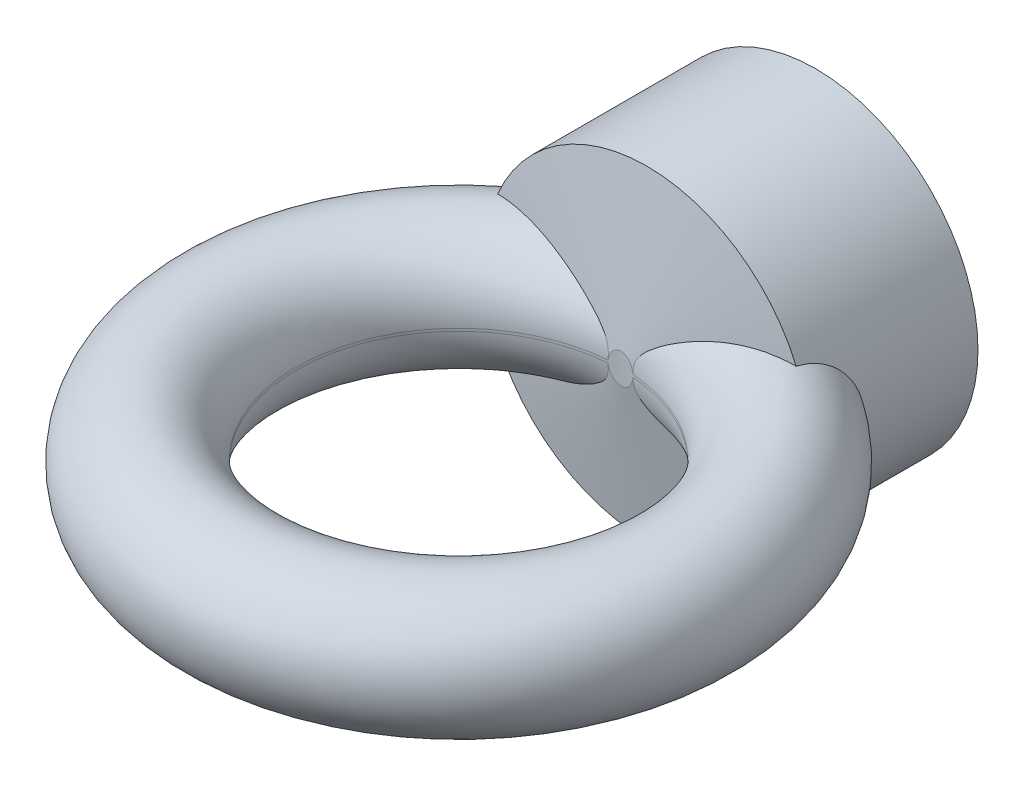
ISO-10303-21;
HEADER;
FILE_DESCRIPTION(('STEP AP214'),'2;1');
FILE_NAME('part.step','',(''),(''),'','','');
FILE_SCHEMA(('AUTOMOTIVE_DESIGN { 1 0 10303 214 1 1 1 1 }'));
ENDSEC;
DATA;
#1=APPLICATION_CONTEXT('core data for automotive mechanical design processes');
#2=APPLICATION_PROTOCOL_DEFINITION('international standard','automotive_design',2000,#1);
#3=PRODUCT_CONTEXT('',#1,'mechanical');
#4=PRODUCT('Part','Part','',(#3));
#5=PRODUCT_RELATED_PRODUCT_CATEGORY('part','',(#4));
#6=PRODUCT_DEFINITION_FORMATION('','',#4);
#7=PRODUCT_DEFINITION_CONTEXT('part definition',#1,'design');
#8=PRODUCT_DEFINITION('design','',#6,#7);
#9=PRODUCT_DEFINITION_SHAPE('','',#8);
#10=(LENGTH_UNIT() NAMED_UNIT(*) SI_UNIT(.MILLI.,.METRE.));
#11=(NAMED_UNIT(*) PLANE_ANGLE_UNIT() SI_UNIT($,.RADIAN.));
#12=(NAMED_UNIT(*) SI_UNIT($,.STERADIAN.) SOLID_ANGLE_UNIT());
#13=UNCERTAINTY_MEASURE_WITH_UNIT(LENGTH_MEASURE(1.E-05),#10,'distance_accuracy_value','');
#14=(GEOMETRIC_REPRESENTATION_CONTEXT(3) GLOBAL_UNCERTAINTY_ASSIGNED_CONTEXT((#13)) GLOBAL_UNIT_ASSIGNED_CONTEXT((#10,
#11,#12)) REPRESENTATION_CONTEXT('',''));
#15=CARTESIAN_POINT('',(0.,0.,0.));
#16=DIRECTION('',(0.,0.,1.));
#17=DIRECTION('',(1.,0.,0.));
#18=AXIS2_PLACEMENT_3D('',#15,#16,#17);
#19=CARTESIAN_POINT('',(398.,-2.07299455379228E-13,78.8999999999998));
#20=DIRECTION('',(0.,0.,-1.));
#21=DIRECTION('',(-1.,0.,0.));
#22=AXIS2_PLACEMENT_3D('',#19,#20,#21);
#23=PLANE('',#22);
#24=CARTESIAN_POINT('',(398.,-2.07299455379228E-13,78.8999999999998));
#25=DIRECTION('',(0.,0.,1.));
#26=DIRECTION('',(1.,0.,0.));
#27=AXIS2_PLACEMENT_3D('',#24,#25,#26);
#28=CIRCLE('',#27,12.5);
#29=CARTESIAN_POINT('',(410.5,-2.07993344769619E-13,78.8999999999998));
#30=VERTEX_POINT('',#29);
#31=EDGE_CURVE('E123',#30,#30,#28,.T.);
#32=ORIENTED_EDGE('',*,*,#31,.F.);
#33=EDGE_LOOP('',(#32));
#34=FACE_BOUND('',#33,.T.);
#35=ADVANCED_FACE('F16',(#34),#23,.T.);
#36=CARTESIAN_POINT('',(398.,0.,106.4));
#37=DIRECTION('',(0.,-1.,0.));
#38=DIRECTION('',(0.,0.,-1.));
#39=AXIS2_PLACEMENT_3D('',#36,#37,#38);
#40=CYLINDRICAL_SURFACE('',#39,12.501);
#41=CARTESIAN_POINT('',(397.048005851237,0.0999962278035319,93.9353015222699));
#42=CARTESIAN_POINT('',(397.053521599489,0.175523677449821,93.9349001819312));
#43=CARTESIAN_POINT('',(397.065339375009,0.250662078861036,93.9339819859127));
#44=CARTESIAN_POINT('',(397.101593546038,0.398461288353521,93.9313058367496));
#45=CARTESIAN_POINT('',(397.126133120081,0.471096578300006,93.9295410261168));
#46=CARTESIAN_POINT('',(397.187341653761,0.609940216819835,93.9254066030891));
#47=CARTESIAN_POINT('',(397.223845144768,0.676221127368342,93.923045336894));
#48=CARTESIAN_POINT('',(397.308750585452,0.800452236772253,93.9180538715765));
#49=CARTESIAN_POINT('',(397.357104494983,0.858434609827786,93.9154247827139));
#50=CARTESIAN_POINT('',(397.448082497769,0.946257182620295,93.9111348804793));
#51=CARTESIAN_POINT('',(397.487714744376,0.97920926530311,93.9094298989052));
#52=CARTESIAN_POINT('',(397.571858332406,1.0382425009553,93.9062630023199));
#53=CARTESIAN_POINT('',(397.616367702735,1.06432641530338,93.9048009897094));
#54=CARTESIAN_POINT('',(397.709775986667,1.10827636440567,93.9022815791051));
#55=CARTESIAN_POINT('',(397.758707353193,1.12607455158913,93.9012275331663));
#56=CARTESIAN_POINT('',(397.859117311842,1.15173584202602,93.8996935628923));
#57=CARTESIAN_POINT('',(397.910593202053,1.15960925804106,93.8992130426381));
#58=CARTESIAN_POINT('',(398.007103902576,1.16439621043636,93.8989215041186));
#59=CARTESIAN_POINT('',(398.052076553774,1.16263815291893,93.8990293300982));
#60=CARTESIAN_POINT('',(398.141013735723,1.15130609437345,93.8997162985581));
#61=CARTESIAN_POINT('',(398.184978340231,1.14173266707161,93.9002954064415));
#62=CARTESIAN_POINT('',(398.269182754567,1.11585894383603,93.9018298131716));
#63=CARTESIAN_POINT('',(398.309498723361,1.09980193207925,93.9027714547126));
#64=CARTESIAN_POINT('',(398.387246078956,1.06182974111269,93.9049387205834));
#65=CARTESIAN_POINT('',(398.424676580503,1.0399127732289,93.9061644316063));
#66=CARTESIAN_POINT('',(398.500189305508,0.988348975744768,93.9089472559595));
#67=CARTESIAN_POINT('',(398.537862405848,0.958106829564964,93.9105261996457));
#68=CARTESIAN_POINT('',(398.608577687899,0.892652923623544,93.9137720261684));
#69=CARTESIAN_POINT('',(398.641618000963,0.857439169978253,93.9154389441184));
#70=CARTESIAN_POINT('',(398.708562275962,0.776136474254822,93.9190438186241));
#71=CARTESIAN_POINT('',(398.741488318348,0.729242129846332,93.9209746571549));
#72=CARTESIAN_POINT('',(398.800426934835,0.631239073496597,93.9246168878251));
#73=CARTESIAN_POINT('',(398.826429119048,0.580124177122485,93.9263279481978));
#74=CARTESIAN_POINT('',(398.877857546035,0.45973753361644,93.9298257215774));
#75=CARTESIAN_POINT('',(398.900971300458,0.389468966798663,93.9314928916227));
#76=CARTESIAN_POINT('',(398.935352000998,0.246242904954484,93.9340345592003));
#77=CARTESIAN_POINT('',(398.946646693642,0.173292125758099,93.9349109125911));
#78=CARTESIAN_POINT('',(398.951994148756,0.0999962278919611,93.9353015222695));
#79=B_SPLINE_CURVE_WITH_KNOTS('',3,(#41,#42,#43,#44,#45,#46,#47,#48,#49,#50,#51,#52,#53,#54,#55,
#56,#57,#58,#59,#60,#61,#62,#63,#64,#65,#66,#67,#68,#69,#70,#71,#72,#73,#74,#75,#76,#77,#78),
.UNSPECIFIED.,.F.,.F.,(4,2,2,2,2,2,2,2,2,2,2,2,2,2,2,2,2,2,4),(0.,0.227052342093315,
0.455975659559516,0.68185775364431,0.906838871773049,1.06096165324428,1.2150223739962,
1.37032334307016,1.5254628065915,1.6597932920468,1.79411391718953,1.92380389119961,
2.05353349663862,2.19800236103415,2.34252933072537,2.51388128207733,2.68548893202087,
2.90640793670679,3.12680713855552),.UNSPECIFIED.);
#80=CARTESIAN_POINT('',(397.048005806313,0.0999956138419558,93.935301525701));
#81=VERTEX_POINT('',#80);
#82=CARTESIAN_POINT('',(398.951994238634,0.099994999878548,93.9353015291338));
#83=VERTEX_POINT('',#82);
#84=EDGE_CURVE('E116',#81,#83,#79,.T.);
#85=ORIENTED_EDGE('',*,*,#84,.F.);
#86=CARTESIAN_POINT('',(398.,0.0999949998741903,106.4));
#87=DIRECTION('',(0.,-1.,0.));
#88=DIRECTION('',(1.,0.,0.));
#89=AXIS2_PLACEMENT_3D('',#86,#87,#88);
#90=CIRCLE('',#89,12.501);
#91=EDGE_CURVE('E115',#83,#81,#90,.T.);
#92=ORIENTED_EDGE('',*,*,#91,.F.);
#93=EDGE_LOOP('',(#85,#92));
#94=FACE_BOUND('',#93,.T.);
#95=CARTESIAN_POINT('',(398.951994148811,-0.0999962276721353,93.9353015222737));
#96=CARTESIAN_POINT('',(398.946478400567,-0.175523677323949,93.9349001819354));
#97=CARTESIAN_POINT('',(398.934660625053,-0.250662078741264,93.9339819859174));
#98=CARTESIAN_POINT('',(398.898406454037,-0.398461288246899,93.931305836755));
#99=CARTESIAN_POINT('',(398.873866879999,-0.47109657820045,93.9295410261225));
#100=CARTESIAN_POINT('',(398.81265834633,-0.60994021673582,93.9254066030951));
#101=CARTESIAN_POINT('',(398.776154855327,-0.676221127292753,93.9230453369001));
#102=CARTESIAN_POINT('',(398.691249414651,-0.800452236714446,93.9180538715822));
#103=CARTESIAN_POINT('',(398.642895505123,-0.858434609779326,93.9154247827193));
#104=CARTESIAN_POINT('',(398.551917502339,-0.946257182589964,93.9111348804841));
#105=CARTESIAN_POINT('',(398.512285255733,-0.979209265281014,93.9094298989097));
#106=CARTESIAN_POINT('',(398.428141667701,-1.03824250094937,93.9062630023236));
#107=CARTESIAN_POINT('',(398.38363229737,-1.06432641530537,93.9048009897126));
#108=CARTESIAN_POINT('',(398.290224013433,-1.10827636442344,93.9022815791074));
#109=CARTESIAN_POINT('',(398.241292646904,-1.12607455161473,93.9012275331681));
#110=CARTESIAN_POINT('',(398.140882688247,-1.15173584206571,93.8996935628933));
#111=CARTESIAN_POINT('',(398.089406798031,-1.15960925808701,93.8992130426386));
#112=CARTESIAN_POINT('',(397.9928960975,-1.16439621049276,93.8989215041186));
#113=CARTESIAN_POINT('',(397.947923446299,-1.16263815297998,93.899029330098));
#114=CARTESIAN_POINT('',(397.858986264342,-1.15130609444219,93.8997162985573));
#115=CARTESIAN_POINT('',(397.81502165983,-1.14173266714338,93.9002954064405));
#116=CARTESIAN_POINT('',(397.730817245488,-1.11585894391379,93.9018298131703));
#117=CARTESIAN_POINT('',(397.690501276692,-1.09980193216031,93.9027714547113));
#118=CARTESIAN_POINT('',(397.612753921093,-1.06182974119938,93.9049387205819));
#119=CARTESIAN_POINT('',(397.575323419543,-1.03991277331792,93.9061644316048));
#120=CARTESIAN_POINT('',(397.499810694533,-0.988348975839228,93.9089472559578));
#121=CARTESIAN_POINT('',(397.462137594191,-0.958106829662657,93.910526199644));
#122=CARTESIAN_POINT('',(397.391422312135,-0.892652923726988,93.9137720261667));
#123=CARTESIAN_POINT('',(397.358381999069,-0.857439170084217,93.9154389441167));
#124=CARTESIAN_POINT('',(397.291437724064,-0.776136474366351,93.9190438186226));
#125=CARTESIAN_POINT('',(397.258511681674,-0.72924212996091,93.9209746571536));
#126=CARTESIAN_POINT('',(397.19957306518,-0.631239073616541,93.9246168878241));
#127=CARTESIAN_POINT('',(397.173570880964,-0.580124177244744,93.926327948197));
#128=CARTESIAN_POINT('',(397.122142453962,-0.459737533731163,93.9298257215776));
#129=CARTESIAN_POINT('',(397.099028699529,-0.389468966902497,93.9314928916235));
#130=CARTESIAN_POINT('',(397.064647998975,-0.246242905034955,93.9340345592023));
#131=CARTESIAN_POINT('',(397.053353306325,-0.173292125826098,93.9349109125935));
#132=CARTESIAN_POINT('',(397.048005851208,-0.099996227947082,93.9353015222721));
#133=B_SPLINE_CURVE_WITH_KNOTS('',3,(#95,#96,#97,#98,#99,#100,#101,#102,#103,#104,#105,#106,
#107,#108,#109,#110,#111,#112,#113,#114,#115,#116,#117,#118,#119,#120,#121,#122,#123,#124,#125,
#126,#127,#128,#129,#130,#131,#132),.UNSPECIFIED.,.F.,.F.,(4,2,2,2,2,2,2,2,2,2,2,2,2,2,2,2,2,2,
4),(0.,0.227052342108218,0.455975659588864,0.68185775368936,0.906838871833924,1.0609616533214,
1.21502237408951,1.37032334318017,1.52546280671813,1.6597932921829,1.7941139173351,
1.92380389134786,2.05353349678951,2.19800236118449,2.3425293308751,2.51388128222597,
2.68548893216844,2.90640793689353,3.1268071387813),.UNSPECIFIED.);
#134=CARTESIAN_POINT('',(398.95199419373,-0.0999956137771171,93.9353015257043));
#135=VERTEX_POINT('',#134);
#136=CARTESIAN_POINT('',(397.048005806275,-0.0999956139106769,93.9353015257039));
#137=VERTEX_POINT('',#136);
#138=EDGE_CURVE('E22',#135,#137,#133,.T.);
#139=ORIENTED_EDGE('',*,*,#138,.F.);
#140=CARTESIAN_POINT('',(398.,-0.0999949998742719,106.4));
#141=DIRECTION('',(0.,-1.,0.));
#142=DIRECTION('',(1.,0.,0.));
#143=AXIS2_PLACEMENT_3D('',#140,#141,#142);
#144=CIRCLE('',#143,12.501);
#145=EDGE_CURVE('E60',#137,#135,#144,.F.);
#146=ORIENTED_EDGE('',*,*,#145,.F.);
#147=EDGE_LOOP('',(#139,#146));
#148=FACE_BOUND('',#147,.T.);
#149=ADVANCED_FACE('F71',(#94,#148),#40,.F.);
#150=CARTESIAN_POINT('',(398.,-1.51788304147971E-13,91.9000000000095));
#151=DIRECTION('',(0.,0.,-1.));
#152=DIRECTION('',(-1.,0.,0.));
#153=AXIS2_PLACEMENT_3D('',#150,#151,#152);
#154=CONICAL_SURFACE('',#153,12.4999999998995,1.39626340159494);
#155=CARTESIAN_POINT('',(398.,-1.51788304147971E-13,91.8999999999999));
#156=DIRECTION('',(0.,0.,1.));
#157=DIRECTION('',(1.,0.,0.));
#158=AXIS2_PLACEMENT_3D('',#155,#156,#157);
#159=CIRCLE('',#158,12.5);
#160=CARTESIAN_POINT('',(409.500623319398,-4.89751603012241,91.8999999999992));
#161=VERTEX_POINT('',#160);
#162=CARTESIAN_POINT('',(386.499376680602,-4.89751603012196,91.8999999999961));
#163=VERTEX_POINT('',#162);
#164=EDGE_CURVE('E70',#161,#163,#159,.F.);
#165=ORIENTED_EDGE('',*,*,#164,.F.);
#166=CARTESIAN_POINT('',(398.95199424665,-0.0999962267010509,93.9353015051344));
#167=CARTESIAN_POINT('',(398.952304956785,-0.142163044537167,93.9344798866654));
#168=CARTESIAN_POINT('',(398.952743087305,-0.184324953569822,93.9331316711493));
#169=CARTESIAN_POINT('',(398.95433561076,-0.268863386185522,93.9294091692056));
#170=CARTESIAN_POINT('',(398.955494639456,-0.311239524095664,93.9270282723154));
#171=CARTESIAN_POINT('',(398.959002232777,-0.395976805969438,93.9212727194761));
#172=CARTESIAN_POINT('',(398.961353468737,-0.438337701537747,93.9178958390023));
#173=CARTESIAN_POINT('',(398.967860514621,-0.522279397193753,93.910268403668));
#174=CARTESIAN_POINT('',(398.971991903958,-0.563863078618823,93.9060300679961));
#175=CARTESIAN_POINT('',(398.982680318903,-0.64654286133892,93.8967524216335));
#176=CARTESIAN_POINT('',(398.989231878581,-0.68763984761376,93.8917149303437));
#177=CARTESIAN_POINT('',(399.005273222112,-0.769120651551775,93.8809568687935));
#178=CARTESIAN_POINT('',(399.014759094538,-0.809505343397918,93.8752372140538));
#179=CARTESIAN_POINT('',(399.035106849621,-0.882712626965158,93.8642411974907));
#180=CARTESIAN_POINT('',(399.045483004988,-0.915682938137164,93.8590475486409));
#181=CARTESIAN_POINT('',(399.068481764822,-0.980818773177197,93.8483594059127));
#182=CARTESIAN_POINT('',(399.081106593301,-1.01298346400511,93.842864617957));
#183=CARTESIAN_POINT('',(399.108476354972,-1.07635817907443,93.8316586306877));
#184=CARTESIAN_POINT('',(399.123221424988,-1.10756814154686,93.8259474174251));
#185=CARTESIAN_POINT('',(399.154610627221,-1.16893545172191,93.8143833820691));
#186=CARTESIAN_POINT('',(399.1712523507,-1.19909407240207,93.8085307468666));
#187=CARTESIAN_POINT('',(399.206214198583,-1.25839312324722,93.7967294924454));
#188=CARTESIAN_POINT('',(399.224534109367,-1.28753368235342,93.7907808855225));
#189=CARTESIAN_POINT('',(399.262622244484,-1.34483479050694,93.7788242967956));
#190=CARTESIAN_POINT('',(399.282390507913,-1.37299531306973,93.7728163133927));
#191=CARTESIAN_POINT('',(399.348948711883,-1.46344849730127,93.7531453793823));
#192=CARTESIAN_POINT('',(399.39828777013,-1.52385573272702,93.7394129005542));
#193=CARTESIAN_POINT('',(399.501388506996,-1.64085074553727,93.7119204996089));
#194=CARTESIAN_POINT('',(399.555157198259,-1.69743219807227,93.6981605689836));
#195=CARTESIAN_POINT('',(399.665858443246,-1.80749526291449,93.6706631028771));
#196=CARTESIAN_POINT('',(399.722793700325,-1.86097414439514,93.6569255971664));
#197=CARTESIAN_POINT('',(399.839708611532,-1.96601478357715,93.6293223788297));
#198=CARTESIAN_POINT('',(399.899717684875,-2.01754369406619,93.6154572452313));
#199=CARTESIAN_POINT('',(400.021487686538,-2.11834535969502,93.5877860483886));
#200=CARTESIAN_POINT('',(400.083246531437,-2.16762062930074,93.5739799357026));
#201=CARTESIAN_POINT('',(400.208200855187,-2.26428271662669,93.5464087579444));
#202=CARTESIAN_POINT('',(400.271395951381,-2.31167002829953,93.5326436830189));
#203=CARTESIAN_POINT('',(400.441728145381,-2.43601625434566,93.4959310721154));
#204=CARTESIAN_POINT('',(400.549937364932,-2.51151536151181,93.4730105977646));
#205=CARTESIAN_POINT('',(400.768946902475,-2.65869355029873,93.4272313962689));
#206=CARTESIAN_POINT('',(400.879747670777,-2.73037196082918,93.4043726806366));
#207=CARTESIAN_POINT('',(401.103646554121,-2.87042424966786,93.3586742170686));
#208=CARTESIAN_POINT('',(401.216747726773,-2.93879325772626,93.3358345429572));
#209=CARTESIAN_POINT('',(401.444813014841,-3.07237090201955,93.290199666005));
#210=CARTESIAN_POINT('',(401.559777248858,-3.13757933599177,93.2674044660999));
#211=CARTESIAN_POINT('',(401.907327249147,-3.3287794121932,93.1990498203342));
#212=CARTESIAN_POINT('',(402.142425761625,-3.45025621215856,93.1535507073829));
#213=CARTESIAN_POINT('',(402.617229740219,-3.68089939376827,93.0629487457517));
#214=CARTESIAN_POINT('',(402.856908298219,-3.79012105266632,93.0178450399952));
#215=CARTESIAN_POINT('',(403.341198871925,-3.99642157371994,92.9278980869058));
#216=CARTESIAN_POINT('',(403.58580558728,-4.09351274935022,92.8830546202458));
#217=CARTESIAN_POINT('',(404.079663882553,-4.27488036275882,92.7936564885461));
#218=CARTESIAN_POINT('',(404.328913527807,-4.35916200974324,92.7491017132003));
#219=CARTESIAN_POINT('',(404.881888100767,-4.52936710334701,92.6514788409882));
#220=CARTESIAN_POINT('',(405.18656664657,-4.61226792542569,92.5984843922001));
#221=CARTESIAN_POINT('',(405.801342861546,-4.75607371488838,92.4931225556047));
#222=CARTESIAN_POINT('',(406.111442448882,-4.81697072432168,92.440755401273));
#223=CARTESIAN_POINT('',(406.734549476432,-4.91399637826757,92.3370586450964));
#224=CARTESIAN_POINT('',(407.047542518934,-4.95021297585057,92.2857259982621));
#225=CARTESIAN_POINT('',(407.675540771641,-4.99535251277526,92.18419958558));
#226=CARTESIAN_POINT('',(407.990544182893,-5.0042971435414,92.1340049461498));
#227=CARTESIAN_POINT('',(408.505140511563,-4.99411607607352,92.0531464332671));
#228=CARTESIAN_POINT('',(408.704860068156,-4.98405038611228,92.0220457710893));
#229=CARTESIAN_POINT('',(409.103564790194,-4.95083066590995,91.9604966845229));
#230=CARTESIAN_POINT('',(409.302548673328,-4.92765974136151,91.9300491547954));
#231=CARTESIAN_POINT('',(409.500623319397,-4.89751603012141,91.8999999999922));
#232=B_SPLINE_CURVE_WITH_KNOTS('',3,(#166,#167,#168,#169,#170,#171,#172,#173,#174,#175,#176,
#177,#178,#179,#180,#181,#182,#183,#184,#185,#186,#187,#188,#189,#190,#191,#192,#193,#194,#195,
#196,#197,#198,#199,#200,#201,#202,#203,#204,#205,#206,#207,#208,#209,#210,#211,#212,#213,#214,
#215,#216,#217,#218,#219,#220,#221,#222,#223,#224,#225,#226,#227,#228,#229,#230,#231),
.UNSPECIFIED.,.F.,.F.,(4,2,2,2,2,2,2,2,2,2,2,2,2,2,2,2,2,2,2,2,2,2,2,2,2,2,2,2,2,2,2,2,4),(0.,
0.126534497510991,0.253891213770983,0.381534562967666,0.507479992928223,0.633142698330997,
0.758638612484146,0.863415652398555,0.968296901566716,1.0731849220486,1.17794118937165,
1.28268414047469,1.38742991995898,1.62467744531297,1.86230805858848,2.10014475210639,
2.34099282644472,2.58156527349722,2.82207435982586,3.22372890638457,3.62545377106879,
4.02775289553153,4.43007773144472,5.23524456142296,6.03661977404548,6.8371747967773,
7.63740338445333,8.59717078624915,9.55728495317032,10.5139594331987,11.4698728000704,
12.0766120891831,12.6841353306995),.UNSPECIFIED.);
#233=EDGE_CURVE('E68',#135,#161,#232,.T.);
#234=ORIENTED_EDGE('',*,*,#233,.F.);
#235=ORIENTED_EDGE('',*,*,#138,.T.);
#236=CARTESIAN_POINT('',(386.499376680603,-4.89751603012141,91.8999999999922));
#237=CARTESIAN_POINT('',(386.683740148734,-4.92557666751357,91.9279690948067));
#238=CARTESIAN_POINT('',(386.868918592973,-4.94759451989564,91.956287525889));
#239=CARTESIAN_POINT('',(387.239848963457,-4.98019717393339,92.0134796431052));
#240=CARTESIAN_POINT('',(387.425599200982,-4.99080299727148,92.0423522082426));
#241=CARTESIAN_POINT('',(387.797209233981,-5.00132996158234,92.1005984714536));
#242=CARTESIAN_POINT('',(387.983068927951,-5.00125645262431,92.129971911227));
#243=CARTESIAN_POINT('',(388.353902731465,-4.99110588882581,92.1890753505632));
#244=CARTESIAN_POINT('',(388.538877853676,-4.98105743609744,92.2188040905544));
#245=CARTESIAN_POINT('',(388.908099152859,-4.95161255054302,92.2786505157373));
#246=CARTESIAN_POINT('',(389.092344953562,-4.93221180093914,92.3087683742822));
#247=CARTESIAN_POINT('',(389.459675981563,-4.88464340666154,92.3693302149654));
#248=CARTESIAN_POINT('',(389.642760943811,-4.85647382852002,92.3997742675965));
#249=CARTESIAN_POINT('',(390.091858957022,-4.77697306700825,92.4750974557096));
#250=CARTESIAN_POINT('',(390.357023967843,-4.72095660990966,92.520134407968));
#251=CARTESIAN_POINT('',(390.88340824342,-4.5929031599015,92.6106779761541));
#252=CARTESIAN_POINT('',(391.144626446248,-4.52086193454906,92.6561847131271));
#253=CARTESIAN_POINT('',(391.662582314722,-4.36210294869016,92.7475769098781));
#254=CARTESIAN_POINT('',(391.919318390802,-4.27538009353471,92.7934624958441));
#255=CARTESIAN_POINT('',(392.427689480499,-4.08842757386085,92.8855075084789));
#256=CARTESIAN_POINT('',(392.679325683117,-3.98820110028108,92.9316668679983));
#257=CARTESIAN_POINT('',(393.177019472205,-3.77508489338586,93.0241946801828));
#258=CARTESIAN_POINT('',(393.423078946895,-3.6621995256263,93.0705630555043));
#259=CARTESIAN_POINT('',(393.909032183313,-3.42419054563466,93.1634639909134));
#260=CARTESIAN_POINT('',(394.148929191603,-3.29907355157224,93.2099964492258));
#261=CARTESIAN_POINT('',(394.490747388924,-3.10896785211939,93.2774185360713));
#262=CARTESIAN_POINT('',(394.595519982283,-3.04904328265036,93.2982410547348));
#263=CARTESIAN_POINT('',(394.803495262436,-2.92654016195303,93.3399241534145));
#264=CARTESIAN_POINT('',(394.906698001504,-2.86396169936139,93.3607847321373));
#265=CARTESIAN_POINT('',(395.111619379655,-2.73576380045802,93.4026115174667));
#266=CARTESIAN_POINT('',(395.213332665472,-2.67013583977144,93.423577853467));
#267=CARTESIAN_POINT('',(395.414606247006,-2.53570075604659,93.4655603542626));
#268=CARTESIAN_POINT('',(395.514166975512,-2.46689428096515,93.4865765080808));
#269=CARTESIAN_POINT('',(395.678424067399,-2.34871971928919,93.5217803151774));
#270=CARTESIAN_POINT('',(395.743856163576,-2.30036872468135,93.5359493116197));
#271=CARTESIAN_POINT('',(395.873270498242,-2.20173436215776,93.5643288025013));
#272=CARTESIAN_POINT('',(395.93725237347,-2.15145051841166,93.5785393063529));
#273=CARTESIAN_POINT('',(396.063460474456,-2.04857617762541,93.6070219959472));
#274=CARTESIAN_POINT('',(396.125684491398,-1.99598297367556,93.6212942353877));
#275=CARTESIAN_POINT('',(396.247487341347,-1.8883201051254,93.6498273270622));
#276=CARTESIAN_POINT('',(396.307076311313,-1.83326194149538,93.6640879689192));
#277=CARTESIAN_POINT('',(396.422988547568,-1.71990180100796,93.692636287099));
#278=CARTESIAN_POINT('',(396.479314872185,-1.66160296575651,93.7069239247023));
#279=CARTESIAN_POINT('',(396.587357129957,-1.54097813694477,93.7354769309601));
#280=CARTESIAN_POINT('',(396.639080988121,-1.47865939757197,93.7497422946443));
#281=CARTESIAN_POINT('',(396.716423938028,-1.37508102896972,93.7724053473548));
#282=CARTESIAN_POINT('',(396.744176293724,-1.33543047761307,93.7808557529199));
#283=CARTESIAN_POINT('',(396.796708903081,-1.25416329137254,93.7976254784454));
#284=CARTESIAN_POINT('',(396.82148928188,-1.21254673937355,93.8059448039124));
#285=CARTESIAN_POINT('',(396.867271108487,-1.12756791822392,93.8222783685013));
#286=CARTESIAN_POINT('',(396.888295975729,-1.08421869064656,93.8302942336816));
#287=CARTESIAN_POINT('',(396.926185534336,-0.995668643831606,93.8458978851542));
#288=CARTESIAN_POINT('',(396.943051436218,-0.950468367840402,93.8534857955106));
#289=CARTESIAN_POINT('',(396.972382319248,-0.858525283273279,93.8680174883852));
#290=CARTESIAN_POINT('',(396.984843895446,-0.811781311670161,93.8749607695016));
#291=CARTESIAN_POINT('',(397.005607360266,-0.717259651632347,93.887966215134));
#292=CARTESIAN_POINT('',(397.0139078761,-0.669481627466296,93.8940280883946));
#293=CARTESIAN_POINT('',(397.027144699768,-0.573032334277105,93.9051090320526));
#294=CARTESIAN_POINT('',(397.032057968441,-0.524357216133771,93.9101208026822));
#295=CARTESIAN_POINT('',(397.03945809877,-0.426728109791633,93.9189050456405));
#296=CARTESIAN_POINT('',(397.041944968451,-0.377774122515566,93.9226775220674));
#297=CARTESIAN_POINT('',(397.045088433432,-0.290541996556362,93.9282016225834));
#298=CARTESIAN_POINT('',(397.04602760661,-0.252288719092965,93.9302153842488));
#299=CARTESIAN_POINT('',(397.047348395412,-0.176024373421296,93.9333913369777));
#300=CARTESIAN_POINT('',(397.047734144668,-0.138013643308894,93.9345598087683));
#301=CARTESIAN_POINT('',(397.048005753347,-0.0999962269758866,93.9353015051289));
#302=B_SPLINE_CURVE_WITH_KNOTS('',3,(#236,#237,#238,#239,#240,#241,#242,#243,#244,#245,#246,
#247,#248,#249,#250,#251,#252,#253,#254,#255,#256,#257,#258,#259,#260,#261,#262,#263,#264,#265,
#266,#267,#268,#269,#270,#271,#272,#273,#274,#275,#276,#277,#278,#279,#280,#281,#282,#283,#284,
#285,#286,#287,#288,#289,#290,#291,#292,#293,#294,#295,#296,#297,#298,#299,#300,#301),
.UNSPECIFIED.,.F.,.F.,(4,2,2,2,2,2,2,2,2,2,2,2,2,2,2,2,2,2,2,2,2,2,2,2,2,2,2,2,2,2,2,2,4),(0.,
0.565544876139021,1.13004618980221,1.69426470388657,2.25687003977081,2.81973530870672,
3.38272477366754,4.20635238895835,5.03019779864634,5.85432967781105,6.67826715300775,
7.50192135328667,8.32513233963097,8.69254883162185,9.05995306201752,9.42845463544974,
9.79688141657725,10.0446018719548,10.2923837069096,10.5404641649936,10.7874880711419,
11.0342765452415,11.2806314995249,11.4279188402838,11.5751999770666,11.7215279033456,
11.86781318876,12.0142113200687,12.1606577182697,12.3080906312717,12.4555230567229,
12.5704637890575,12.6845414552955),.UNSPECIFIED.);
#303=EDGE_CURVE('E67',#163,#137,#302,.T.);
#304=ORIENTED_EDGE('',*,*,#303,.F.);
#305=EDGE_LOOP('',(#165,#234,#235,#304));
#306=FACE_BOUND('',#305,.T.);
#307=ADVANCED_FACE('F66',(#306),#154,.T.);
#308=CARTESIAN_POINT('',(398.,0.,85.3999999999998));
#309=DIRECTION('',(0.,0.,1.));
#310=DIRECTION('',(1.,0.,0.));
#311=AXIS2_PLACEMENT_3D('',#308,#309,#310);
#312=CYLINDRICAL_SURFACE('',#311,12.5);
#313=ORIENTED_EDGE('',*,*,#31,.T.);
#314=EDGE_LOOP('',(#313));
#315=FACE_BOUND('',#314,.T.);
#316=CARTESIAN_POINT('',(398.,-1.24032728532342E-13,91.8999999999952));
#317=DIRECTION('',(0.,0.,-1.));
#318=DIRECTION('',(1.,0.,0.));
#319=AXIS2_PLACEMENT_3D('',#316,#317,#318);
#320=CIRCLE('',#319,12.5000000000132);
#321=CARTESIAN_POINT('',(409.500623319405,4.89751603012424,91.8999999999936));
#322=VERTEX_POINT('',#321);
#323=CARTESIAN_POINT('',(386.499376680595,4.89751603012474,91.8999999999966));
#324=VERTEX_POINT('',#323);
#325=EDGE_CURVE('E113',#322,#324,#320,.F.);
#326=ORIENTED_EDGE('',*,*,#325,.F.);
#327=CARTESIAN_POINT('',(409.500623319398,-4.89751603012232,91.8999999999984));
#328=CARTESIAN_POINT('',(409.507610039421,-4.88110031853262,91.8036380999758));
#329=CARTESIAN_POINT('',(409.5154718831,-4.86254981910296,91.7076908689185));
#330=CARTESIAN_POINT('',(409.532938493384,-4.82098151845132,91.5168319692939));
#331=CARTESIAN_POINT('',(409.542544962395,-4.79795935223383,91.4219214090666));
#332=CARTESIAN_POINT('',(409.563482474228,-4.74727485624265,91.2335076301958));
#333=CARTESIAN_POINT('',(409.574813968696,-4.71961131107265,91.1400047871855));
#334=CARTESIAN_POINT('',(409.599170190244,-4.65943225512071,90.9545271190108));
#335=CARTESIAN_POINT('',(409.612199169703,-4.62690452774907,90.8625568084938));
#336=CARTESIAN_POINT('',(409.639827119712,-4.55695486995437,90.6807627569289));
#337=CARTESIAN_POINT('',(409.6544256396,-4.51953434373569,90.590938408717));
#338=CARTESIAN_POINT('',(409.68505458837,-4.43974367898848,90.4137822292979));
#339=CARTESIAN_POINT('',(409.701084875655,-4.39737402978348,90.3264501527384));
#340=CARTESIAN_POINT('',(409.742879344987,-4.28485710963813,90.1109366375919));
#341=CARTESIAN_POINT('',(409.769450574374,-4.21153505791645,89.9845477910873));
#342=CARTESIAN_POINT('',(409.82471987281,-4.05376111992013,89.7393995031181));
#343=CARTESIAN_POINT('',(409.853418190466,-3.9693079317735,89.6206409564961));
#344=CARTESIAN_POINT('',(409.911991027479,-3.78990109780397,89.3920663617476));
#345=CARTESIAN_POINT('',(409.941862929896,-3.69497004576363,89.282231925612));
#346=CARTESIAN_POINT('',(410.001874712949,-3.49512228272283,89.0721534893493));
#347=CARTESIAN_POINT('',(410.032014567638,-3.39020652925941,88.9719085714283));
#348=CARTESIAN_POINT('',(410.088993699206,-3.18071859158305,88.7900013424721));
#349=CARTESIAN_POINT('',(410.115892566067,-3.07690537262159,88.7074814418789));
#350=CARTESIAN_POINT('',(410.168372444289,-2.86232630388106,88.5514826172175));
#351=CARTESIAN_POINT('',(410.193953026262,-2.75155821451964,88.4780066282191));
#352=CARTESIAN_POINT('',(410.243126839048,-2.52377378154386,88.3404134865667));
#353=CARTESIAN_POINT('',(410.266717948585,-2.40675098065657,88.2763062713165));
#354=CARTESIAN_POINT('',(410.311262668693,-2.16740126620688,88.1578132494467));
#355=CARTESIAN_POINT('',(410.332216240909,-2.04507427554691,88.1034275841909));
#356=CARTESIAN_POINT('',(410.370941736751,-1.79601748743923,88.0045926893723));
#357=CARTESIAN_POINT('',(410.388714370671,-1.66928868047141,87.960141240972));
#358=CARTESIAN_POINT('',(410.420630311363,-1.41233693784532,87.8813198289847));
#359=CARTESIAN_POINT('',(410.434774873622,-1.28211522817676,87.846946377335));
#360=CARTESIAN_POINT('',(410.459067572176,-1.01932092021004,87.7884242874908));
#361=CARTESIAN_POINT('',(410.469223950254,-0.886753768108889,87.7642545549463));
#362=CARTESIAN_POINT('',(410.485330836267,-0.619963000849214,87.7261126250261));
#363=CARTESIAN_POINT('',(410.491283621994,-0.485740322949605,87.7121349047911));
#364=CARTESIAN_POINT('',(410.496708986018,-0.292726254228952,87.6994149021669));
#365=CARTESIAN_POINT('',(410.497942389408,-0.234228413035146,87.6965271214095));
#366=CARTESIAN_POINT('',(410.499588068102,-0.117156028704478,87.6926760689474));
#367=CARTESIAN_POINT('',(410.500000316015,-0.0585814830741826,87.6917128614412));
#368=CARTESIAN_POINT('',(410.499999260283,0.13712564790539,87.6917135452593));
#369=CARTESIAN_POINT('',(410.497738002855,0.274289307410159,87.6969927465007));
#370=CARTESIAN_POINT('',(410.4887446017,0.547712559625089,87.7181027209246));
#371=CARTESIAN_POINT('',(410.48200993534,0.683971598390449,87.7339394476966));
#372=CARTESIAN_POINT('',(410.464218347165,0.954837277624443,87.7761679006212));
#373=CARTESIAN_POINT('',(410.453153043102,1.08944018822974,87.8025800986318));
#374=CARTESIAN_POINT('',(410.426974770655,1.35580826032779,87.865895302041));
#375=CARTESIAN_POINT('',(410.411860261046,1.48757232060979,87.9028023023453));
#376=CARTESIAN_POINT('',(410.377986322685,1.74716203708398,87.9869541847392));
#377=CARTESIAN_POINT('',(410.359229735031,1.8749906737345,88.0341910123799));
#378=CARTESIAN_POINT('',(410.318544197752,2.12594343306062,88.1388782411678));
#379=CARTESIAN_POINT('',(410.296613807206,2.2490653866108,88.1963332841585));
#380=CARTESIAN_POINT('',(410.250186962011,2.48956015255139,88.3211754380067));
#381=CARTESIAN_POINT('',(410.22569214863,2.60693657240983,88.3885562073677));
#382=CARTESIAN_POINT('',(410.174804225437,2.83510134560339,88.5329385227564));
#383=CARTESIAN_POINT('',(410.14841203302,2.94589283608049,88.6099354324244));
#384=CARTESIAN_POINT('',(410.094734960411,3.15900889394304,88.7723191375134));
#385=CARTESIAN_POINT('',(410.067462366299,3.26141016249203,88.8576093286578));
#386=CARTESIAN_POINT('',(410.01252654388,3.45827242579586,89.03671830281));
#387=CARTESIAN_POINT('',(409.984863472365,3.55273650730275,89.1305337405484));
#388=CARTESIAN_POINT('',(409.929897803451,3.73315349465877,89.3261146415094));
#389=CARTESIAN_POINT('',(409.902595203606,3.81910645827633,89.427880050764));
#390=CARTESIAN_POINT('',(409.849089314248,3.98201413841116,89.6386370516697));
#391=CARTESIAN_POINT('',(409.822885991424,4.05896912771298,89.7476284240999));
#392=CARTESIAN_POINT('',(409.772582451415,4.20262090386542,89.9705646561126));
#393=CARTESIAN_POINT('',(409.748459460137,4.26943724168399,90.0844274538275));
#394=CARTESIAN_POINT('',(409.702502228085,4.3938413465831,90.3175319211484));
#395=CARTESIAN_POINT('',(409.680668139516,4.45142850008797,90.4367739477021));
#396=CARTESIAN_POINT('',(409.639733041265,4.55739432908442,90.6797217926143));
#397=CARTESIAN_POINT('',(409.620632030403,4.60577300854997,90.8034276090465));
#398=CARTESIAN_POINT('',(409.585475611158,4.69350481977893,91.0543757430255));
#399=CARTESIAN_POINT('',(409.569419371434,4.73286041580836,91.1816170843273));
#400=CARTESIAN_POINT('',(409.544058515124,4.79432304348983,91.4073142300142));
#401=CARTESIAN_POINT('',(409.534063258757,4.8182941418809,91.5051929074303));
#402=CARTESIAN_POINT('',(409.515947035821,4.86142824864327,91.7019012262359));
#403=CARTESIAN_POINT('',(409.507821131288,4.88060393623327,91.8007276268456));
#404=CARTESIAN_POINT('',(409.500623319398,4.89751603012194,91.8999999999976));
#405=B_SPLINE_CURVE_WITH_KNOTS('',3,(#327,#328,#329,#330,#331,#332,#333,#334,#335,#336,#337,
#338,#339,#340,#341,#342,#343,#344,#345,#346,#347,#348,#349,#350,#351,#352,#353,#354,#355,#356,
#357,#358,#359,#360,#361,#362,#363,#364,#365,#366,#367,#368,#369,#370,#371,#372,#373,#374,#375,
#376,#377,#378,#379,#380,#381,#382,#383,#384,#385,#386,#387,#388,#389,#390,#391,#392,#393,#394,
#395,#396,#397,#398,#399,#400,#401,#402,#403,#404),.UNSPECIFIED.,.F.,.F.,(4,2,2,2,2,2,2,2,2,2,2,
2,2,2,2,2,2,2,2,2,2,2,2,2,2,2,2,2,2,2,2,2,2,2,2,2,2,2,4),(0.,0.293988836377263,0.58826610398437,
0.882620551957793,1.17772710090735,1.47274914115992,1.76774203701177,2.21263322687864,
2.6575764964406,3.10157840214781,3.54553777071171,3.95100306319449,4.35659959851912,
4.7626232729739,5.168652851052,5.57459165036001,5.98038978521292,6.38534484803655,
6.79008030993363,6.96579572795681,7.14151700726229,7.55283971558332,7.96439457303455,
8.37674999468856,8.78926259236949,9.20145468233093,9.61383449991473,10.0259519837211,
10.4378715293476,10.8454650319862,11.2528992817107,11.6603307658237,12.0677498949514,
12.469912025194,12.8721008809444,13.2742895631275,13.6763682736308,13.9800345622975,
14.2828892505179),.UNSPECIFIED.);
#406=EDGE_CURVE('E33',#161,#322,#405,.T.);
#407=ORIENTED_EDGE('',*,*,#406,.F.);
#408=ORIENTED_EDGE('',*,*,#164,.T.);
#409=CARTESIAN_POINT('',(386.499376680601,4.89751603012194,91.8999999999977));
#410=CARTESIAN_POINT('',(386.492389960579,4.88110031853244,91.803638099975));
#411=CARTESIAN_POINT('',(386.4845281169,4.86254981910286,91.7076908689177));
#412=CARTESIAN_POINT('',(386.467061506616,4.82098151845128,91.516831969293));
#413=CARTESIAN_POINT('',(386.457455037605,4.79795935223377,91.4219214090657));
#414=CARTESIAN_POINT('',(386.436517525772,4.74727485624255,91.2335076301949));
#415=CARTESIAN_POINT('',(386.425186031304,4.71961131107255,91.1400047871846));
#416=CARTESIAN_POINT('',(386.400829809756,4.65943225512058,90.95452711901));
#417=CARTESIAN_POINT('',(386.387800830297,4.62690452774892,90.862556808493));
#418=CARTESIAN_POINT('',(386.360172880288,4.55695486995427,90.680762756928));
#419=CARTESIAN_POINT('',(386.3455743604,4.51953434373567,90.5909384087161));
#420=CARTESIAN_POINT('',(386.31494541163,4.4397436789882,90.4137822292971));
#421=CARTESIAN_POINT('',(386.298915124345,4.39737402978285,90.3264501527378));
#422=CARTESIAN_POINT('',(386.257120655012,4.28485710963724,90.1109366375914));
#423=CARTESIAN_POINT('',(386.230549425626,4.21153505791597,89.9845477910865));
#424=CARTESIAN_POINT('',(386.17528012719,4.05376111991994,89.739399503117));
#425=CARTESIAN_POINT('',(386.146581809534,3.9693079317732,89.6206409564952));
#426=CARTESIAN_POINT('',(386.088008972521,3.78990109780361,89.3920663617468));
#427=CARTESIAN_POINT('',(386.058137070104,3.69497004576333,89.2822319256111));
#428=CARTESIAN_POINT('',(385.99812528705,3.49512228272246,89.0721534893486));
#429=CARTESIAN_POINT('',(385.967985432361,3.3902065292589,88.9719085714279));
#430=CARTESIAN_POINT('',(385.911006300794,3.1807185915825,88.7900013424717));
#431=CARTESIAN_POINT('',(385.884107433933,3.07690537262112,88.7074814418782));
#432=CARTESIAN_POINT('',(385.831627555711,2.8623263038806,88.5514826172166));
#433=CARTESIAN_POINT('',(385.806046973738,2.75155821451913,88.4780066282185));
#434=CARTESIAN_POINT('',(385.756873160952,2.52377378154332,88.340413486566));
#435=CARTESIAN_POINT('',(385.733282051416,2.40675098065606,88.2763062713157));
#436=CARTESIAN_POINT('',(385.688737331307,2.16740126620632,88.1578132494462));
#437=CARTESIAN_POINT('',(385.66778375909,2.04507427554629,88.1034275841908));
#438=CARTESIAN_POINT('',(385.629058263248,1.7960174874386,88.0045926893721));
#439=CARTESIAN_POINT('',(385.611285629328,1.66928868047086,87.9601412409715));
#440=CARTESIAN_POINT('',(385.579369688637,1.41233693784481,87.881319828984));
#441=CARTESIAN_POINT('',(385.565225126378,1.28211522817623,87.8469463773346));
#442=CARTESIAN_POINT('',(385.540932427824,1.01932092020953,87.7884242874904));
#443=CARTESIAN_POINT('',(385.530776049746,0.886753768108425,87.7642545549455));
#444=CARTESIAN_POINT('',(385.514669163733,0.619963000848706,87.726112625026));
#445=CARTESIAN_POINT('',(385.508716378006,0.485740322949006,87.7121349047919));
#446=CARTESIAN_POINT('',(385.503291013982,0.292726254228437,87.699414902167));
#447=CARTESIAN_POINT('',(385.502057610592,0.23422841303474,87.6965271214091));
#448=CARTESIAN_POINT('',(385.500411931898,0.117156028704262,87.6926760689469));
#449=CARTESIAN_POINT('',(385.499999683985,0.0585814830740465,87.6917128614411));
#450=CARTESIAN_POINT('',(385.500000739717,-0.137125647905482,87.6917135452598));
#451=CARTESIAN_POINT('',(385.502261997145,-0.274289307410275,87.6969927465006));
#452=CARTESIAN_POINT('',(385.5112553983,-0.547712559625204,87.7181027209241));
#453=CARTESIAN_POINT('',(385.51799006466,-0.68397159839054,87.7339394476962));
#454=CARTESIAN_POINT('',(385.535781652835,-0.954837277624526,87.7761679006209));
#455=CARTESIAN_POINT('',(385.546846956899,-1.08944018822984,87.8025800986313));
#456=CARTESIAN_POINT('',(385.573025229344,-1.35580826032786,87.8658953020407));
#457=CARTESIAN_POINT('',(385.588139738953,-1.48757232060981,87.9028023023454));
#458=CARTESIAN_POINT('',(385.622013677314,-1.74716203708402,87.9869541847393));
#459=CARTESIAN_POINT('',(385.640770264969,-1.87499067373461,88.0341910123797));
#460=CARTESIAN_POINT('',(385.681455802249,-2.12594343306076,88.1388782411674));
#461=CARTESIAN_POINT('',(385.703386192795,-2.24906538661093,88.1963332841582));
#462=CARTESIAN_POINT('',(385.749813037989,-2.48956015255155,88.3211754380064));
#463=CARTESIAN_POINT('',(385.774307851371,-2.60693657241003,88.3885562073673));
#464=CARTESIAN_POINT('',(385.825195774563,-2.83510134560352,88.5329385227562));
#465=CARTESIAN_POINT('',(385.851587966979,-2.9458928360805,88.6099354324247));
#466=CARTESIAN_POINT('',(385.905265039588,-3.15900889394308,88.7723191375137));
#467=CARTESIAN_POINT('',(385.932537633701,-3.26141016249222,88.8576093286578));
#468=CARTESIAN_POINT('',(385.98747345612,-3.45827242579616,89.0367183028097));
#469=CARTESIAN_POINT('',(386.015136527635,-3.55273650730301,89.1305337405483));
#470=CARTESIAN_POINT('',(386.070102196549,-3.73315349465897,89.3261146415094));
#471=CARTESIAN_POINT('',(386.097404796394,-3.8191064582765,89.4278800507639));
#472=CARTESIAN_POINT('',(386.150910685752,-3.98201413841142,89.6386370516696));
#473=CARTESIAN_POINT('',(386.177114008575,-4.05896912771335,89.7476284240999));
#474=CARTESIAN_POINT('',(386.227417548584,-4.20262090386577,89.9705646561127));
#475=CARTESIAN_POINT('',(386.251540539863,-4.2694372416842,90.0844274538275));
#476=CARTESIAN_POINT('',(386.297497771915,-4.39384134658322,90.3175319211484));
#477=CARTESIAN_POINT('',(386.319331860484,-4.45142850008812,90.4367739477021));
#478=CARTESIAN_POINT('',(386.360266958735,-4.55739432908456,90.6797217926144));
#479=CARTESIAN_POINT('',(386.379367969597,-4.60577300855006,90.8034276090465));
#480=CARTESIAN_POINT('',(386.414524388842,-4.6935048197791,91.0543757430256));
#481=CARTESIAN_POINT('',(386.430580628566,-4.73286041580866,91.1816170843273));
#482=CARTESIAN_POINT('',(386.455941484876,-4.79432304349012,91.4073142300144));
#483=CARTESIAN_POINT('',(386.465936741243,-4.81829414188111,91.5051929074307));
#484=CARTESIAN_POINT('',(386.484052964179,-4.86142824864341,91.7019012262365));
#485=CARTESIAN_POINT('',(386.492178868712,-4.88060393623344,91.8007276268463));
#486=CARTESIAN_POINT('',(386.499376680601,-4.89751603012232,91.8999999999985));
#487=B_SPLINE_CURVE_WITH_KNOTS('',3,(#409,#410,#411,#412,#413,#414,#415,#416,#417,#418,#419,
#420,#421,#422,#423,#424,#425,#426,#427,#428,#429,#430,#431,#432,#433,#434,#435,#436,#437,#438,
#439,#440,#441,#442,#443,#444,#445,#446,#447,#448,#449,#450,#451,#452,#453,#454,#455,#456,#457,
#458,#459,#460,#461,#462,#463,#464,#465,#466,#467,#468,#469,#470,#471,#472,#473,#474,#475,#476,
#477,#478,#479,#480,#481,#482,#483,#484,#485,#486),.UNSPECIFIED.,.F.,.F.,(4,2,2,2,2,2,2,2,2,2,2,
2,2,2,2,2,2,2,2,2,2,2,2,2,2,2,2,2,2,2,2,2,2,2,2,2,2,2,4),(0.,0.293988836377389,
0.588266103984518,0.882620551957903,1.17772710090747,1.47274914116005,1.76774203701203,
2.21263322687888,2.65757649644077,3.10157840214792,3.54553777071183,3.95100306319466,
4.3565995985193,4.76262327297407,5.16865285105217,5.57459165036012,5.980389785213,
6.38534484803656,6.7900803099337,6.96579572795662,7.14151700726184,7.55283971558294,
7.9643945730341,8.37674999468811,8.78926259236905,9.20145468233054,9.61383449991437,
10.0259519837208,10.4378715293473,10.845465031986,11.2528992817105,11.6603307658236,
12.0677498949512,12.4699120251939,12.8721008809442,13.2742895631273,13.6763682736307,
13.9800345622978,14.2828892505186),.UNSPECIFIED.);
#488=EDGE_CURVE('E75',#324,#163,#487,.T.);
#489=ORIENTED_EDGE('',*,*,#488,.F.);
#490=EDGE_LOOP('',(#326,#407,#408,#489));
#491=FACE_BOUND('',#490,.T.);
#492=ADVANCED_FACE('F95',(#315,#491),#312,.T.);
#493=CARTESIAN_POINT('',(398.,-1.51788304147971E-13,91.9000000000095));
#494=DIRECTION('',(0.,0.,-1.));
#495=DIRECTION('',(-1.,0.,0.));
#496=AXIS2_PLACEMENT_3D('',#493,#494,#495);
#497=CONICAL_SURFACE('',#496,12.4999999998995,1.39626340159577);
#498=ORIENTED_EDGE('',*,*,#325,.T.);
#499=CARTESIAN_POINT('',(397.048005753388,0.0999962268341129,93.9353015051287));
#500=CARTESIAN_POINT('',(397.047695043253,0.142163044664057,93.9344798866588));
#501=CARTESIAN_POINT('',(397.047256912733,0.18432495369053,93.9331316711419));
#502=CARTESIAN_POINT('',(397.045664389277,0.268863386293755,93.9294091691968));
#503=CARTESIAN_POINT('',(397.044505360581,0.311239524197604,93.9270282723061));
#504=CARTESIAN_POINT('',(397.04099776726,0.395976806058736,93.9212727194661));
#505=CARTESIAN_POINT('',(397.038646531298,0.438337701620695,93.9178958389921));
#506=CARTESIAN_POINT('',(397.032139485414,0.522279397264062,93.9102684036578));
#507=CARTESIAN_POINT('',(397.028008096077,0.563863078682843,93.9060300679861));
#508=CARTESIAN_POINT('',(397.017319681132,0.646542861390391,93.896752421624));
#509=CARTESIAN_POINT('',(397.010768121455,0.687639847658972,93.8917149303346));
#510=CARTESIAN_POINT('',(396.994726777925,0.76912065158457,93.8809568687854));
#511=CARTESIAN_POINT('',(396.985240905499,0.809505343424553,93.8752372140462));
#512=CARTESIAN_POINT('',(396.964893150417,0.882712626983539,93.8642411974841));
#513=CARTESIAN_POINT('',(396.954516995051,0.915682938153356,93.8590475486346));
#514=CARTESIAN_POINT('',(396.931518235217,0.980818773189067,93.8483594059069));
#515=CARTESIAN_POINT('',(396.918893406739,1.01298346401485,93.8428646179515));
#516=CARTESIAN_POINT('',(396.891523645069,1.07635817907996,93.8316586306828));
#517=CARTESIAN_POINT('',(396.876778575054,1.1075681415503,93.8259474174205));
#518=CARTESIAN_POINT('',(396.845389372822,1.16893545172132,93.8143833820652));
#519=CARTESIAN_POINT('',(396.828747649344,1.19909407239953,93.808530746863));
#520=CARTESIAN_POINT('',(396.793785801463,1.25839312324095,93.7967294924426));
#521=CARTESIAN_POINT('',(396.77546589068,1.28753368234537,93.79078088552));
#522=CARTESIAN_POINT('',(396.737377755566,1.34483479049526,93.7788242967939));
#523=CARTESIAN_POINT('',(396.717609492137,1.3729953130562,93.7728163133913));
#524=CARTESIAN_POINT('',(396.65105128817,1.46344849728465,93.7531453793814));
#525=CARTESIAN_POINT('',(396.601712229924,1.52385573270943,93.7394129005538));
#526=CARTESIAN_POINT('',(396.498611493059,1.64085074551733,93.7119204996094));
#527=CARTESIAN_POINT('',(396.444842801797,1.69743219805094,93.6981605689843));
#528=CARTESIAN_POINT('',(396.334141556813,1.80749526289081,93.6706631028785));
#529=CARTESIAN_POINT('',(396.277206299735,1.8609741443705,93.6569255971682));
#530=CARTESIAN_POINT('',(396.160291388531,1.9660147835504,93.6293223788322));
#531=CARTESIAN_POINT('',(396.100282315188,2.0175436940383,93.6154572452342));
#532=CARTESIAN_POINT('',(395.978512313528,2.11834535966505,93.5877860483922));
#533=CARTESIAN_POINT('',(395.916753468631,2.16762062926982,93.5739799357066));
#534=CARTESIAN_POINT('',(395.791799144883,2.26428271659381,93.5464087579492));
#535=CARTESIAN_POINT('',(395.72860404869,2.31167002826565,93.5326436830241));
#536=CARTESIAN_POINT('',(395.558271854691,2.43601625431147,93.4959310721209));
#537=CARTESIAN_POINT('',(395.45006263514,2.51151536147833,93.4730105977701));
#538=CARTESIAN_POINT('',(395.231053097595,2.65869355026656,93.4272313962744));
#539=CARTESIAN_POINT('',(395.120252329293,2.7303719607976,93.404372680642));
#540=CARTESIAN_POINT('',(394.896353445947,2.87042424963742,93.3586742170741));
#541=CARTESIAN_POINT('',(394.783252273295,2.93879325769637,93.3358345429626));
#542=CARTESIAN_POINT('',(394.555186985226,3.07237090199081,93.2901996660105));
#543=CARTESIAN_POINT('',(394.440222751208,3.13757933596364,93.2674044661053));
#544=CARTESIAN_POINT('',(394.092672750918,3.32877941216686,93.1990498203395));
#545=CARTESIAN_POINT('',(393.857574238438,3.45025621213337,93.1535507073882));
#546=CARTESIAN_POINT('',(393.382770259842,3.68089939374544,93.0629487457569));
#547=CARTESIAN_POINT('',(393.14309170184,3.79012105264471,93.0178450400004));
#548=CARTESIAN_POINT('',(392.658801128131,3.99642157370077,92.9278980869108));
#549=CARTESIAN_POINT('',(392.414194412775,4.09351274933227,92.8830546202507));
#550=CARTESIAN_POINT('',(391.920336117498,4.27488036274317,92.7936564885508));
#551=CARTESIAN_POINT('',(391.671086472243,4.35916200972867,92.749101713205));
#552=CARTESIAN_POINT('',(391.11811189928,4.52936710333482,92.6514788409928));
#553=CARTESIAN_POINT('',(390.813433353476,4.61226792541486,92.5984843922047));
#554=CARTESIAN_POINT('',(390.198657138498,4.75607371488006,92.4931225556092));
#555=CARTESIAN_POINT('',(389.88855755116,4.8169707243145,92.4407554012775));
#556=CARTESIAN_POINT('',(389.265450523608,4.91399637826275,92.3370586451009));
#557=CARTESIAN_POINT('',(388.952457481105,4.95021297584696,92.2857259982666));
#558=CARTESIAN_POINT('',(388.324459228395,4.99535251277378,92.1841995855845));
#559=CARTESIAN_POINT('',(388.009455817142,5.00429714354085,92.1340049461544));
#560=CARTESIAN_POINT('',(387.494859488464,4.9941160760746,92.0531464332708));
#561=CARTESIAN_POINT('',(387.295139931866,4.98405038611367,92.0220457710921));
#562=CARTESIAN_POINT('',(386.896435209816,4.95083066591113,91.960496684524));
#563=CARTESIAN_POINT('',(386.697451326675,4.92765974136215,91.9300491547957));
#564=CARTESIAN_POINT('',(386.4993766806,4.89751603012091,91.899999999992));
#565=B_SPLINE_CURVE_WITH_KNOTS('',3,(#499,#500,#501,#502,#503,#504,#505,#506,#507,#508,#509,
#510,#511,#512,#513,#514,#515,#516,#517,#518,#519,#520,#521,#522,#523,#524,#525,#526,#527,#528,
#529,#530,#531,#532,#533,#534,#535,#536,#537,#538,#539,#540,#541,#542,#543,#544,#545,#546,#547,
#548,#549,#550,#551,#552,#553,#554,#555,#556,#557,#558,#559,#560,#561,#562,#563,#564),
.UNSPECIFIED.,.F.,.F.,(4,2,2,2,2,2,2,2,2,2,2,2,2,2,2,2,2,2,2,2,2,2,2,2,2,2,2,2,2,2,2,2,4),(0.,
0.126534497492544,0.25389121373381,0.381534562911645,0.50747999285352,0.633142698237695,
0.758638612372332,0.863415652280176,0.968296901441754,1.07318492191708,1.17794118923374,
1.2826841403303,1.38742991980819,1.62467744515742,1.86230805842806,2.1001447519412,
2.34099282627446,2.58156527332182,2.8220743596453,3.22372890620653,3.6254537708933,
4.0277528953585,4.43007773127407,5.23524456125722,6.03661977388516,6.83717479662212,
7.63740338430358,8.59717078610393,9.55728495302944,10.513959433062,11.469872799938,
12.0766120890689,12.6841353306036),.UNSPECIFIED.);
#566=EDGE_CURVE('E78',#81,#324,#565,.T.);
#567=ORIENTED_EDGE('',*,*,#566,.F.);
#568=ORIENTED_EDGE('',*,*,#84,.T.);
#569=CARTESIAN_POINT('',(409.500623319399,4.89751603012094,91.8999999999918));
#570=CARTESIAN_POINT('',(409.316259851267,4.92557666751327,91.9279690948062));
#571=CARTESIAN_POINT('',(409.131081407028,4.94759451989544,91.9562875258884));
#572=CARTESIAN_POINT('',(408.760151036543,4.98019717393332,92.0134796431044));
#573=CARTESIAN_POINT('',(408.574400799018,4.99080299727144,92.0423522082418));
#574=CARTESIAN_POINT('',(408.202790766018,5.00132996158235,92.1005984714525));
#575=CARTESIAN_POINT('',(408.016931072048,5.00125645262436,92.1299719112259));
#576=CARTESIAN_POINT('',(407.646097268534,4.9911058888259,92.1890753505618));
#577=CARTESIAN_POINT('',(407.461122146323,4.98105743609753,92.2188040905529));
#578=CARTESIAN_POINT('',(407.091900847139,4.95161255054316,92.2786505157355));
#579=CARTESIAN_POINT('',(406.907655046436,4.93221180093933,92.3087683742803));
#580=CARTESIAN_POINT('',(406.540324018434,4.88464340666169,92.3693302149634));
#581=CARTESIAN_POINT('',(406.357239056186,4.8564738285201,92.3997742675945));
#582=CARTESIAN_POINT('',(405.908141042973,4.77697306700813,92.4750974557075));
#583=CARTESIAN_POINT('',(405.642976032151,4.72095660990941,92.5201344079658));
#584=CARTESIAN_POINT('',(405.116591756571,4.5929031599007,92.6106779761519));
#585=CARTESIAN_POINT('',(404.855373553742,4.52086193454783,92.656184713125));
#586=CARTESIAN_POINT('',(404.337417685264,4.36210294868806,92.747576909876));
#587=CARTESIAN_POINT('',(404.080681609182,4.27538009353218,92.793462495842));
#588=CARTESIAN_POINT('',(403.572310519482,4.08842757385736,92.8855075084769));
#589=CARTESIAN_POINT('',(403.320674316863,3.98820110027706,92.9316668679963));
#590=CARTESIAN_POINT('',(402.822980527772,3.77508489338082,93.024194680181));
#591=CARTESIAN_POINT('',(402.57692105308,3.66219952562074,93.0705630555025));
#592=CARTESIAN_POINT('',(402.09096781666,3.42419054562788,93.1634639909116));
#593=CARTESIAN_POINT('',(401.851070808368,3.29907355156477,93.2099964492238));
#594=CARTESIAN_POINT('',(401.509252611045,3.10896785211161,93.2774185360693));
#595=CARTESIAN_POINT('',(401.404480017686,3.04904328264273,93.2982410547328));
#596=CARTESIAN_POINT('',(401.196504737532,2.92654016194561,93.3399241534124));
#597=CARTESIAN_POINT('',(401.093301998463,2.86396169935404,93.3607847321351));
#598=CARTESIAN_POINT('',(400.888380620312,2.73576380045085,93.4026115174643));
#599=CARTESIAN_POINT('',(400.786667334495,2.6701358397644,93.4235778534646));
#600=CARTESIAN_POINT('',(400.58539375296,2.53570075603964,93.46556035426));
#601=CARTESIAN_POINT('',(400.485833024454,2.46689428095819,93.486576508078));
#602=CARTESIAN_POINT('',(400.321575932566,2.34871971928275,93.5217803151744));
#603=CARTESIAN_POINT('',(400.256143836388,2.30036872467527,93.5359493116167));
#604=CARTESIAN_POINT('',(400.126729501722,2.20173436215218,93.5643288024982));
#605=CARTESIAN_POINT('',(400.062747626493,2.15145051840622,93.5785393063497));
#606=CARTESIAN_POINT('',(399.936539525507,2.04857617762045,93.6070219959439));
#607=CARTESIAN_POINT('',(399.874315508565,1.99598297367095,93.6212942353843));
#608=CARTESIAN_POINT('',(399.752512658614,1.88832010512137,93.6498273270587));
#609=CARTESIAN_POINT('',(399.692923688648,1.83326194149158,93.6640879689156));
#610=CARTESIAN_POINT('',(399.577011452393,1.71990180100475,93.6926362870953));
#611=CARTESIAN_POINT('',(399.520685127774,1.66160296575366,93.7069239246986));
#612=CARTESIAN_POINT('',(399.412642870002,1.54097813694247,93.7354769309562));
#613=CARTESIAN_POINT('',(399.360919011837,1.47865939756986,93.7497422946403));
#614=CARTESIAN_POINT('',(399.28357606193,1.37508102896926,93.7724053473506));
#615=CARTESIAN_POINT('',(399.255823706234,1.33543047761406,93.7808557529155));
#616=CARTESIAN_POINT('',(399.203291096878,1.25416329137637,93.7976254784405));
#617=CARTESIAN_POINT('',(399.178510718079,1.21254673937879,93.8059448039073));
#618=CARTESIAN_POINT('',(399.132728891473,1.12756791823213,93.8222783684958));
#619=CARTESIAN_POINT('',(399.111704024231,1.08421869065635,93.8302942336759));
#620=CARTESIAN_POINT('',(399.073814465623,0.995668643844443,93.8458978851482));
#621=CARTESIAN_POINT('',(399.056948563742,0.950468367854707,93.8534857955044));
#622=CARTESIAN_POINT('',(399.027617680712,0.858525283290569,93.8680174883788));
#623=CARTESIAN_POINT('',(399.015156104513,0.811781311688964,93.8749607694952));
#624=CARTESIAN_POINT('',(398.994392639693,0.717259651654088,93.8879662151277));
#625=CARTESIAN_POINT('',(398.986092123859,0.669481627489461,93.8940280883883));
#626=CARTESIAN_POINT('',(398.972855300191,0.573032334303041,93.9051090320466));
#627=CARTESIAN_POINT('',(398.967942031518,0.524357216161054,93.9101208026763));
#628=CARTESIAN_POINT('',(398.960541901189,0.426728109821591,93.9189050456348));
#629=CARTESIAN_POINT('',(398.958055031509,0.377774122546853,93.9226775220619));
#630=CARTESIAN_POINT('',(398.954911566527,0.290541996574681,93.9282016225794));
#631=CARTESIAN_POINT('',(398.953972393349,0.252288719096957,93.9302153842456));
#632=CARTESIAN_POINT('',(398.952651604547,0.176024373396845,93.9333913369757));
#633=CARTESIAN_POINT('',(398.952265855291,0.138013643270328,93.9345598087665));
#634=CARTESIAN_POINT('',(398.951994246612,0.0999962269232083,93.935301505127));
#635=B_SPLINE_CURVE_WITH_KNOTS('',3,(#569,#570,#571,#572,#573,#574,#575,#576,#577,#578,#579,
#580,#581,#582,#583,#584,#585,#586,#587,#588,#589,#590,#591,#592,#593,#594,#595,#596,#597,#598,
#599,#600,#601,#602,#603,#604,#605,#606,#607,#608,#609,#610,#611,#612,#613,#614,#615,#616,#617,
#618,#619,#620,#621,#622,#623,#624,#625,#626,#627,#628,#629,#630,#631,#632,#633,#634),
.UNSPECIFIED.,.F.,.F.,(4,2,2,2,2,2,2,2,2,2,2,2,2,2,2,2,2,2,2,2,2,2,2,2,2,2,2,2,2,2,2,2,4),(0.,
0.56554487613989,1.13004618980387,1.694264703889,2.256870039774,2.81973530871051,
3.38272477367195,4.20635238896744,5.03019779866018,5.85432967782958,6.67826715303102,
7.50192135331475,8.32513233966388,8.69254883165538,9.05995306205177,9.42845463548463,
9.79688141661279,10.0446018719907,10.2923837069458,10.54046416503,10.7874880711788,
11.0342765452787,11.2806314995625,11.4279188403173,11.5751999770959,11.7215279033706,
11.8678131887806,12.0142113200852,12.1606577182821,12.3080906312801,12.4555230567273,
12.570463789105,12.6845414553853),.UNSPECIFIED.);
#636=EDGE_CURVE('E11',#322,#83,#635,.T.);
#637=ORIENTED_EDGE('',*,*,#636,.F.);
#638=EDGE_LOOP('',(#498,#567,#568,#637));
#639=FACE_BOUND('',#638,.T.);
#640=ADVANCED_FACE('F102',(#639),#497,.T.);
#641=CARTESIAN_POINT('',(398.,0.,106.4));
#642=DIRECTION('',(0.,-1.,0.));
#643=DIRECTION('',(1.,0.,0.));
#644=AXIS2_PLACEMENT_3D('',#641,#642,#643);
#645=TOROIDAL_SURFACE('',#644,17.5000000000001,5.);
#646=ORIENTED_EDGE('',*,*,#406,.T.);
#647=ORIENTED_EDGE('',*,*,#636,.T.);
#648=ORIENTED_EDGE('',*,*,#91,.T.);
#649=ORIENTED_EDGE('',*,*,#566,.T.);
#650=ORIENTED_EDGE('',*,*,#488,.T.);
#651=ORIENTED_EDGE('',*,*,#303,.T.);
#652=ORIENTED_EDGE('',*,*,#145,.T.);
#653=ORIENTED_EDGE('',*,*,#233,.T.);
#654=EDGE_LOOP('',(#646,#647,#648,#649,#650,#651,#652,#653));
#655=FACE_BOUND('',#654,.T.);
#656=ADVANCED_FACE('F18',(#655),#645,.T.);
#657=CLOSED_SHELL('',(#35,#149,#307,#492,#640,#656));
#658=MANIFOLD_SOLID_BREP('B1',#657);
#659=ADVANCED_BREP_SHAPE_REPRESENTATION('',(#18,#658),#14);
#660=SHAPE_DEFINITION_REPRESENTATION(#9,#659);
ENDSEC;
END-ISO-10303-21;
